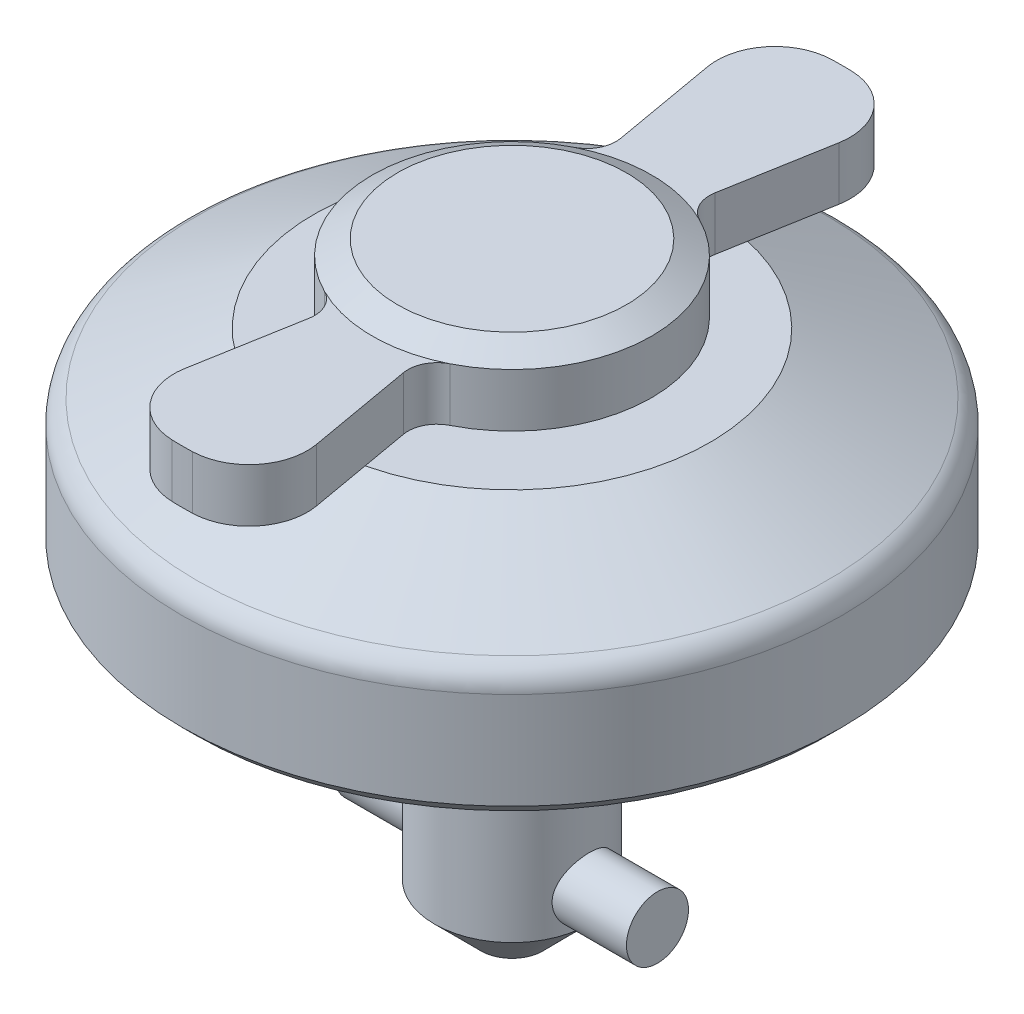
ISO-10303-21;
HEADER;
FILE_DESCRIPTION(('STEP AP214'),'2;1');
FILE_NAME('part.step','',(''),(''),'','','');
FILE_SCHEMA(('AUTOMOTIVE_DESIGN { 1 0 10303 214 1 1 1 1 }'));
ENDSEC;
DATA;
#1=APPLICATION_CONTEXT('core data for automotive mechanical design processes');
#2=APPLICATION_PROTOCOL_DEFINITION('international standard','automotive_design',2000,#1);
#3=PRODUCT_CONTEXT('',#1,'mechanical');
#4=PRODUCT('Part','Part','',(#3));
#5=PRODUCT_RELATED_PRODUCT_CATEGORY('part','',(#4));
#6=PRODUCT_DEFINITION_FORMATION('','',#4);
#7=PRODUCT_DEFINITION_CONTEXT('part definition',#1,'design');
#8=PRODUCT_DEFINITION('design','',#6,#7);
#9=PRODUCT_DEFINITION_SHAPE('','',#8);
#10=(LENGTH_UNIT() NAMED_UNIT(*) SI_UNIT(.MILLI.,.METRE.));
#11=(NAMED_UNIT(*) PLANE_ANGLE_UNIT() SI_UNIT($,.RADIAN.));
#12=(NAMED_UNIT(*) SI_UNIT($,.STERADIAN.) SOLID_ANGLE_UNIT());
#13=UNCERTAINTY_MEASURE_WITH_UNIT(LENGTH_MEASURE(1.E-05),#10,'distance_accuracy_value','');
#14=(GEOMETRIC_REPRESENTATION_CONTEXT(3) GLOBAL_UNCERTAINTY_ASSIGNED_CONTEXT((#13)) GLOBAL_UNIT_ASSIGNED_CONTEXT((#10,
#11,#12)) REPRESENTATION_CONTEXT('',''));
#15=CARTESIAN_POINT('',(0.,0.,0.));
#16=DIRECTION('',(0.,0.,1.));
#17=DIRECTION('',(1.,0.,0.));
#18=AXIS2_PLACEMENT_3D('',#15,#16,#17);
#19=CARTESIAN_POINT('',(0.,16.,0.));
#20=DIRECTION('',(0.,1.,0.));
#21=DIRECTION('',(0.,0.,1.));
#22=AXIS2_PLACEMENT_3D('',#19,#20,#21);
#23=CYLINDRICAL_SURFACE('',#22,7.2);
#24=CARTESIAN_POINT('',(0.,18.75,0.));
#25=DIRECTION('',(0.,1.,0.));
#26=DIRECTION('',(0.,0.,1.));
#27=AXIS2_PLACEMENT_3D('',#24,#25,#26);
#28=CIRCLE('',#27,7.2);
#29=CARTESIAN_POINT('',(-3.23506859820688,18.75,6.43228817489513));
#30=VERTEX_POINT('',#29);
#31=CARTESIAN_POINT('',(-3.23506859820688,18.75,-6.43228817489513));
#32=VERTEX_POINT('',#31);
#33=EDGE_CURVE('P0_E325',#30,#32,#28,.F.);
#34=ORIENTED_EDGE('',*,*,#33,.T.);
#35=DIRECTION('',(0.,1.,0.));
#36=VECTOR('',#35,1.);
#37=CARTESIAN_POINT('',(-3.23506859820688,16.,-6.43228817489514));
#38=LINE('',#37,#36);
#39=CARTESIAN_POINT('',(-3.23506859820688,16.,-6.43228817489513));
#40=VERTEX_POINT('',#39);
#41=EDGE_CURVE('P0_E242',#32,#40,#38,.F.);
#42=ORIENTED_EDGE('',*,*,#41,.T.);
#43=CARTESIAN_POINT('',(0.,16.,0.));
#44=DIRECTION('',(0.,1.,0.));
#45=DIRECTION('',(0.,0.,1.));
#46=AXIS2_PLACEMENT_3D('',#43,#44,#45);
#47=CIRCLE('',#46,7.2);
#48=CARTESIAN_POINT('',(-3.23506859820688,16.,6.43228817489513));
#49=VERTEX_POINT('',#48);
#50=EDGE_CURVE('P0_E222',#40,#49,#47,.T.);
#51=ORIENTED_EDGE('',*,*,#50,.T.);
#52=DIRECTION('',(0.,1.,0.));
#53=VECTOR('',#52,1.);
#54=CARTESIAN_POINT('',(-3.23506859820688,16.,6.43228817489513));
#55=LINE('',#54,#53);
#56=EDGE_CURVE('P0_E234',#49,#30,#55,.T.);
#57=ORIENTED_EDGE('',*,*,#56,.T.);
#58=EDGE_LOOP('',(#34,#42,#51,#57));
#59=FACE_BOUND('',#58,.T.);
#60=ADVANCED_FACE('P0_F16',(#59),#23,.T.);
#61=CARTESIAN_POINT('',(0.,-11.5,0.));
#62=DIRECTION('',(0.,-1.,0.));
#63=DIRECTION('',(0.,0.,-1.));
#64=AXIS2_PLACEMENT_3D('',#61,#62,#63);
#65=CYLINDRICAL_SURFACE('',#64,3.2);
#66=CARTESIAN_POINT('',(0.,0.,0.));
#67=DIRECTION('',(0.,-1.,0.));
#68=DIRECTION('',(0.,0.,-1.));
#69=AXIS2_PLACEMENT_3D('',#66,#67,#68);
#70=CIRCLE('',#69,3.2);
#71=CARTESIAN_POINT('',(0.,0.,-3.2));
#72=VERTEX_POINT('',#71);
#73=EDGE_CURVE('P0_E146',#72,#72,#70,.T.);
#74=ORIENTED_EDGE('',*,*,#73,.F.);
#75=EDGE_LOOP('',(#74));
#76=FACE_BOUND('',#75,.T.);
#77=CARTESIAN_POINT('',(0.,16.,0.));
#78=DIRECTION('',(0.,1.,0.));
#79=DIRECTION('',(0.,0.,1.));
#80=AXIS2_PLACEMENT_3D('',#77,#78,#79);
#81=CIRCLE('',#80,3.2);
#82=CARTESIAN_POINT('',(0.,16.,3.2));
#83=VERTEX_POINT('',#82);
#84=EDGE_CURVE('P0_E271',#83,#83,#81,.F.);
#85=ORIENTED_EDGE('',*,*,#84,.T.);
#86=EDGE_LOOP('',(#85));
#87=FACE_BOUND('',#86,.T.);
#88=ADVANCED_FACE('P0_F184',(#76,#87),#65,.T.);
#89=CARTESIAN_POINT('',(0.,-11.5,0.));
#90=DIRECTION('',(0.,-1.,0.));
#91=DIRECTION('',(0.,0.,-1.));
#92=AXIS2_PLACEMENT_3D('',#89,#90,#91);
#93=PLANE('',#92);
#94=CARTESIAN_POINT('',(0.,-11.5,0.));
#95=DIRECTION('',(0.,-1.,0.));
#96=DIRECTION('',(0.,0.,-1.));
#97=AXIS2_PLACEMENT_3D('',#94,#95,#96);
#98=CIRCLE('',#97,1.6);
#99=CARTESIAN_POINT('',(0.,-11.5,-1.6));
#100=VERTEX_POINT('',#99);
#101=EDGE_CURVE('P0_E137',#100,#100,#98,.T.);
#102=ORIENTED_EDGE('',*,*,#101,.T.);
#103=EDGE_LOOP('',(#102));
#104=FACE_BOUND('',#103,.T.);
#105=ADVANCED_FACE('P0_F186',(#104),#93,.T.);
#106=CARTESIAN_POINT('',(0.,-11.5,0.));
#107=DIRECTION('',(0.,1.,0.));
#108=DIRECTION('',(0.,0.,1.));
#109=AXIS2_PLACEMENT_3D('',#106,#107,#108);
#110=CONICAL_SURFACE('',#109,1.6,0.78539816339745);
#111=CARTESIAN_POINT('',(0.,-9.10000000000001,0.));
#112=DIRECTION('',(0.,-1.,0.));
#113=DIRECTION('',(0.,0.,-1.));
#114=AXIS2_PLACEMENT_3D('',#111,#112,#113);
#115=CIRCLE('',#114,4.);
#116=CARTESIAN_POINT('',(4.00000000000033,-9.10000000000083,0.));
#117=VERTEX_POINT('',#116);
#118=CARTESIAN_POINT('',(-4.,-9.10000000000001,0.));
#119=VERTEX_POINT('',#118);
#120=EDGE_CURVE('P0_E129',#117,#119,#115,.T.);
#121=ORIENTED_EDGE('',*,*,#120,.T.);
#122=EDGE_CURVE('P0_E133',#119,#117,#115,.T.);
#123=ORIENTED_EDGE('',*,*,#122,.T.);
#124=EDGE_LOOP('',(#121,#123));
#125=FACE_BOUND('',#124,.T.);
#126=ORIENTED_EDGE('',*,*,#101,.F.);
#127=EDGE_LOOP('',(#126));
#128=FACE_BOUND('',#127,.T.);
#129=ADVANCED_FACE('P0_F131',(#125,#128),#110,.T.);
#130=CARTESIAN_POINT('',(0.,-11.5,0.));
#131=DIRECTION('',(0.,-1.,0.));
#132=DIRECTION('',(0.,0.,-1.));
#133=AXIS2_PLACEMENT_3D('',#130,#131,#132);
#134=CYLINDRICAL_SURFACE('',#133,4.);
#135=CARTESIAN_POINT('',(0.,0.,0.));
#136=DIRECTION('',(0.,-1.,0.));
#137=DIRECTION('',(0.,0.,-1.));
#138=AXIS2_PLACEMENT_3D('',#135,#136,#137);
#139=CIRCLE('',#138,4.);
#140=CARTESIAN_POINT('',(0.,0.,-4.));
#141=VERTEX_POINT('',#140);
#142=EDGE_CURVE('P0_E144',#141,#141,#139,.T.);
#143=ORIENTED_EDGE('',*,*,#142,.T.);
#144=EDGE_LOOP('',(#143));
#145=FACE_BOUND('',#144,.T.);
#146=ORIENTED_EDGE('',*,*,#120,.F.);
#147=CARTESIAN_POINT('',(3.66606055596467,-7.50000000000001,1.6));
#148=CARTESIAN_POINT('',(3.66606921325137,-7.58571159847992,1.59999060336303));
#149=CARTESIAN_POINT('',(3.66910881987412,-7.67154442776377,1.59307185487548));
#150=CARTESIAN_POINT('',(3.68088731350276,-7.84074786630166,1.56565522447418));
#151=CARTESIAN_POINT('',(3.68964076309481,-7.9241116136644,1.5451226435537));
#152=CARTESIAN_POINT('',(3.71168364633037,-8.08564235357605,1.49138802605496));
#153=CARTESIAN_POINT('',(3.72495597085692,-8.16382763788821,1.45823372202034));
#154=CARTESIAN_POINT('',(3.75451732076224,-8.3135080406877,1.38033621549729));
#155=CARTESIAN_POINT('',(3.77080568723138,-8.3850046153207,1.335595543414));
#156=CARTESIAN_POINT('',(3.80560692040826,-8.52340832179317,1.23305757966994));
#157=CARTESIAN_POINT('',(3.82419134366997,-8.58988513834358,1.17470348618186));
#158=CARTESIAN_POINT('',(3.86089965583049,-8.71242319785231,1.04776728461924));
#159=CARTESIAN_POINT('',(3.87902338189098,-8.7684808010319,0.979181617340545));
#160=CARTESIAN_POINT('',(3.91362726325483,-8.87072511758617,0.830405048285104));
#161=CARTESIAN_POINT('',(3.93001442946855,-8.91643544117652,0.749863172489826));
#162=CARTESIAN_POINT('',(3.95843142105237,-8.99347485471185,0.581460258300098));
#163=CARTESIAN_POINT('',(3.97046301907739,-9.02480979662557,0.493602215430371));
#164=CARTESIAN_POINT('',(3.98830660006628,-9.07067318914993,0.317573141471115));
#165=CARTESIAN_POINT('',(3.99439149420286,-9.08594185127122,0.229623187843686));
#166=CARTESIAN_POINT('',(4.00064248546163,-9.10162278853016,0.0522130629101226));
#167=CARTESIAN_POINT('',(4.0008107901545,-9.10204060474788,-0.0372465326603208));
#168=CARTESIAN_POINT('',(3.99537570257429,-9.08841378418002,-0.209785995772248));
#169=CARTESIAN_POINT('',(3.99009597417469,-9.07518018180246,-0.292941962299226));
#170=CARTESIAN_POINT('',(3.97479433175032,-9.0360056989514,-0.455738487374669));
#171=CARTESIAN_POINT('',(3.9647720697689,-9.0100638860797,-0.535378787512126));
#172=CARTESIAN_POINT('',(3.9407745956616,-8.94589081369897,-0.690318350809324));
#173=CARTESIAN_POINT('',(3.9267420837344,-8.90748022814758,-0.765534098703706));
#174=CARTESIAN_POINT('',(3.89611668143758,-8.8196279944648,-0.908646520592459));
#175=CARTESIAN_POINT('',(3.87952291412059,-8.77018256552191,-0.976540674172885));
#176=CARTESIAN_POINT('',(3.84417309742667,-8.65788069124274,-1.10781506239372));
#177=CARTESIAN_POINT('',(3.82534661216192,-8.59435688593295,-1.17060627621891));
#178=CARTESIAN_POINT('',(3.78849328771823,-8.45760754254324,-1.28488593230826));
#179=CARTESIAN_POINT('',(3.77046671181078,-8.38437884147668,-1.33637067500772));
#180=CARTESIAN_POINT('',(3.7367751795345,-8.22766478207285,-1.42792335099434));
#181=CARTESIAN_POINT('',(3.72119131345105,-8.14394813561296,-1.46762772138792));
#182=CARTESIAN_POINT('',(3.69510072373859,-7.9702276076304,-1.53214100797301));
#183=CARTESIAN_POINT('',(3.68459070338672,-7.88022785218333,-1.55695959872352));
#184=CARTESIAN_POINT('',(3.67063807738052,-7.70237137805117,-1.58956395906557));
#185=CARTESIAN_POINT('',(3.6668029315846,-7.61471964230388,-1.59829767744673));
#186=CARTESIAN_POINT('',(3.66551598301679,-7.43913823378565,-1.60124906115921));
#187=CARTESIAN_POINT('',(3.6680622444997,-7.35120865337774,-1.59547112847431));
#188=CARTESIAN_POINT('',(3.67884835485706,-7.18283285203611,-1.57042631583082));
#189=CARTESIAN_POINT('',(3.68675566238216,-7.10224565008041,-1.55194644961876));
#190=CARTESIAN_POINT('',(3.70696040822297,-6.9453692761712,-1.50304334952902));
#191=CARTESIAN_POINT('',(3.71925881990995,-6.86908106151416,-1.47261746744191));
#192=CARTESIAN_POINT('',(3.7474702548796,-6.71951811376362,-1.39930851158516));
#193=CARTESIAN_POINT('',(3.76350963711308,-6.64649104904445,-1.35597029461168));
#194=CARTESIAN_POINT('',(3.7972030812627,-6.50841361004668,-1.2585321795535));
#195=CARTESIAN_POINT('',(3.8148577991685,-6.44336650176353,-1.20442789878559));
#196=CARTESIAN_POINT('',(3.85136732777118,-6.31810127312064,-1.08227536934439));
#197=CARTESIAN_POINT('',(3.87021445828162,-6.25859474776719,-1.01349234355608));
#198=CARTESIAN_POINT('',(3.9057583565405,-6.15185833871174,-0.866466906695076));
#199=CARTESIAN_POINT('',(3.92245503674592,-6.10462895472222,-0.788224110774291));
#200=CARTESIAN_POINT('',(3.95186972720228,-6.02396189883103,-0.624223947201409));
#201=CARTESIAN_POINT('',(3.96458868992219,-5.99052092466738,-0.538468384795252));
#202=CARTESIAN_POINT('',(3.98458170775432,-5.93876091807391,-0.36191487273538));
#203=CARTESIAN_POINT('',(3.99185871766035,-5.92043367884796,-0.271119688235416));
#204=CARTESIAN_POINT('',(3.9998320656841,-5.9003962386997,-0.0934532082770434));
#205=CARTESIAN_POINT('',(4.00092677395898,-5.89767989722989,-0.00671239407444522));
#206=CARTESIAN_POINT('',(3.99748833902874,-5.90628438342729,0.165947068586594));
#207=CARTESIAN_POINT('',(3.9929560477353,-5.91760308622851,0.251865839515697));
#208=CARTESIAN_POINT('',(3.97897210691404,-5.95323743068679,0.417736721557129));
#209=CARTESIAN_POINT('',(3.96967584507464,-5.97714315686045,0.497791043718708));
#210=CARTESIAN_POINT('',(3.9471595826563,-6.03684224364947,0.652737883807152));
#211=CARTESIAN_POINT('',(3.93393885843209,-6.07263779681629,0.72762944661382));
#212=CARTESIAN_POINT('',(3.90414475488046,-6.15688255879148,0.873762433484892));
#213=CARTESIAN_POINT('',(3.88744903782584,-6.20582103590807,0.94469630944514));
#214=CARTESIAN_POINT('',(3.85271522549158,-6.31423081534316,1.07764322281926));
#215=CARTESIAN_POINT('',(3.834676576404,-6.3737064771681,1.1396525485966));
#216=CARTESIAN_POINT('',(3.79790210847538,-6.50585217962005,1.25696101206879));
#217=CARTESIAN_POINT('',(3.77919226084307,-6.57911109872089,1.31160710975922));
#218=CARTESIAN_POINT('',(3.74439737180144,-6.73435370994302,1.40787796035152));
#219=CARTESIAN_POINT('',(3.72831263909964,-6.81633842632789,1.44950118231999));
#220=CARTESIAN_POINT('',(3.70207091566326,-6.97922976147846,1.51519287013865));
#221=CARTESIAN_POINT('',(3.69151134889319,-7.05957218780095,1.54050201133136));
#222=CARTESIAN_POINT('',(3.67556802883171,-7.22358833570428,1.57817420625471));
#223=CARTESIAN_POINT('',(3.6701698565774,-7.30725209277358,1.59057333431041));
#224=CARTESIAN_POINT('',(3.66659567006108,-7.42750204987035,1.59877140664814));
#225=CARTESIAN_POINT('',(3.66605689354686,-7.46374017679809,1.6000039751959));
#226=CARTESIAN_POINT('',(3.66606055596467,-7.50000000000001,1.6));
#227=B_SPLINE_CURVE_WITH_KNOTS('',3,(#147,#148,#149,#150,#151,#152,#153,#154,#155,#156,#157,
#158,#159,#160,#161,#162,#163,#164,#165,#166,#167,#168,#169,#170,#171,#172,#173,#174,#175,#176,
#177,#178,#179,#180,#181,#182,#183,#184,#185,#186,#187,#188,#189,#190,#191,#192,#193,#194,#195,
#196,#197,#198,#199,#200,#201,#202,#203,#204,#205,#206,#207,#208,#209,#210,#211,#212,#213,#214,
#215,#216,#217,#218,#219,#220,#221,#222,#223,#224,#225,#226),.UNSPECIFIED.,.T.,.F.,(4,2,2,2,2,2,
2,2,2,2,2,2,2,2,2,2,2,2,2,2,2,2,2,2,2,2,2,2,2,2,2,2,2,2,2,2,2,2,2,4),(0.,0.257022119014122,
0.514701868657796,0.771416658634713,1.02807543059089,1.2980449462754,1.56810859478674,
1.84882135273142,2.12941973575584,2.39643346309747,2.66334756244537,2.91526915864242,
3.16720924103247,3.42294640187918,3.67877131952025,3.95139235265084,4.22410245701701,
4.50451566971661,4.78474643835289,5.04785718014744,5.3108881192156,5.55893798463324,
5.80704286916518,6.06520923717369,6.32348091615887,6.60082987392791,6.87819011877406,
7.15548389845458,7.43262700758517,7.6916883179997,7.95071041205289,8.2017759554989,
8.45288782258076,8.71509640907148,8.97741373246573,9.25597002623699,9.53455905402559,
9.78813328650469,10.040997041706,10.1497288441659),.UNSPECIFIED.);
#228=EDGE_CURVE('P0_E143',#117,#117,#227,.T.);
#229=ORIENTED_EDGE('',*,*,#228,.F.);
#230=ORIENTED_EDGE('',*,*,#122,.F.);
#231=CARTESIAN_POINT('',(-3.66606055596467,-7.50000000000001,1.6));
#232=CARTESIAN_POINT('',(-3.66606921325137,-7.4142884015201,1.59999060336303));
#233=CARTESIAN_POINT('',(-3.66910881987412,-7.32845557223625,1.59307185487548));
#234=CARTESIAN_POINT('',(-3.68088731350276,-7.15925213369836,1.56565522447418));
#235=CARTESIAN_POINT('',(-3.68964076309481,-7.07588838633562,1.5451226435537));
#236=CARTESIAN_POINT('',(-3.71168364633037,-6.91435764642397,1.49138802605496));
#237=CARTESIAN_POINT('',(-3.72495597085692,-6.8361723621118,1.45823372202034));
#238=CARTESIAN_POINT('',(-3.75451732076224,-6.68649195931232,1.38033621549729));
#239=CARTESIAN_POINT('',(-3.77080568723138,-6.61499538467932,1.335595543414));
#240=CARTESIAN_POINT('',(-3.80560692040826,-6.47659167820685,1.23305757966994));
#241=CARTESIAN_POINT('',(-3.82419134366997,-6.41011486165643,1.17470348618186));
#242=CARTESIAN_POINT('',(-3.86089965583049,-6.28757680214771,1.04776728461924));
#243=CARTESIAN_POINT('',(-3.87902338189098,-6.23151919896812,0.979181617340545));
#244=CARTESIAN_POINT('',(-3.91362726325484,-6.12927488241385,0.830405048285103));
#245=CARTESIAN_POINT('',(-3.93001442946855,-6.08356455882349,0.749863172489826));
#246=CARTESIAN_POINT('',(-3.95843142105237,-6.00652514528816,0.581460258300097));
#247=CARTESIAN_POINT('',(-3.97046301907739,-5.97519020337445,0.49360221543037));
#248=CARTESIAN_POINT('',(-3.98830660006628,-5.92932681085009,0.317573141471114));
#249=CARTESIAN_POINT('',(-3.99439149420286,-5.91405814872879,0.229623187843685));
#250=CARTESIAN_POINT('',(-4.00064248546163,-5.89837721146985,0.052213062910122));
#251=CARTESIAN_POINT('',(-4.0008107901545,-5.89795939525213,-0.0372465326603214));
#252=CARTESIAN_POINT('',(-3.99537570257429,-5.91158621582,-0.209785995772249));
#253=CARTESIAN_POINT('',(-3.99009597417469,-5.92481981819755,-0.292941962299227));
#254=CARTESIAN_POINT('',(-3.97479433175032,-5.96399430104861,-0.45573848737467));
#255=CARTESIAN_POINT('',(-3.9647720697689,-5.98993611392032,-0.535378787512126));
#256=CARTESIAN_POINT('',(-3.9407745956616,-6.05410918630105,-0.690318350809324));
#257=CARTESIAN_POINT('',(-3.9267420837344,-6.09251977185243,-0.765534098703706));
#258=CARTESIAN_POINT('',(-3.89611668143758,-6.18037200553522,-0.908646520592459));
#259=CARTESIAN_POINT('',(-3.87952291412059,-6.22981743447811,-0.976540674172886));
#260=CARTESIAN_POINT('',(-3.84417309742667,-6.34211930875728,-1.10781506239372));
#261=CARTESIAN_POINT('',(-3.82534661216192,-6.40564311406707,-1.17060627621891));
#262=CARTESIAN_POINT('',(-3.78849328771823,-6.54239245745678,-1.28488593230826));
#263=CARTESIAN_POINT('',(-3.77046671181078,-6.61562115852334,-1.33637067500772));
#264=CARTESIAN_POINT('',(-3.7367751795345,-6.77233521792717,-1.42792335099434));
#265=CARTESIAN_POINT('',(-3.72119131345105,-6.85605186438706,-1.46762772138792));
#266=CARTESIAN_POINT('',(-3.69510072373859,-7.02977239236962,-1.53214100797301));
#267=CARTESIAN_POINT('',(-3.68459070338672,-7.11977214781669,-1.55695959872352));
#268=CARTESIAN_POINT('',(-3.67063807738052,-7.29762862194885,-1.58956395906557));
#269=CARTESIAN_POINT('',(-3.66680293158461,-7.38528035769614,-1.59829767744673));
#270=CARTESIAN_POINT('',(-3.66551598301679,-7.56086176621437,-1.60124906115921));
#271=CARTESIAN_POINT('',(-3.6680622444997,-7.64879134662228,-1.59547112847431));
#272=CARTESIAN_POINT('',(-3.67884835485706,-7.81716714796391,-1.57042631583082));
#273=CARTESIAN_POINT('',(-3.68675566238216,-7.89775434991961,-1.55194644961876));
#274=CARTESIAN_POINT('',(-3.70696040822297,-8.05463072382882,-1.50304334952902));
#275=CARTESIAN_POINT('',(-3.71925881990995,-8.13091893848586,-1.47261746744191));
#276=CARTESIAN_POINT('',(-3.7474702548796,-8.2804818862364,-1.39930851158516));
#277=CARTESIAN_POINT('',(-3.76350963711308,-8.35350895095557,-1.35597029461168));
#278=CARTESIAN_POINT('',(-3.7972030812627,-8.49158638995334,-1.2585321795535));
#279=CARTESIAN_POINT('',(-3.8148577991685,-8.55663349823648,-1.20442789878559));
#280=CARTESIAN_POINT('',(-3.85136732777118,-8.68189872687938,-1.08227536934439));
#281=CARTESIAN_POINT('',(-3.87021445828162,-8.74140525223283,-1.01349234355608));
#282=CARTESIAN_POINT('',(-3.9057583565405,-8.84814166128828,-0.866466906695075));
#283=CARTESIAN_POINT('',(-3.92245503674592,-8.8953710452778,-0.788224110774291));
#284=CARTESIAN_POINT('',(-3.95186972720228,-8.97603810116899,-0.624223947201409));
#285=CARTESIAN_POINT('',(-3.96458868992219,-9.00947907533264,-0.538468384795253));
#286=CARTESIAN_POINT('',(-3.98458170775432,-9.06123908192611,-0.36191487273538));
#287=CARTESIAN_POINT('',(-3.99185871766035,-9.07956632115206,-0.271119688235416));
#288=CARTESIAN_POINT('',(-3.9998320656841,-9.09960376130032,-0.0934532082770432));
#289=CARTESIAN_POINT('',(-4.00092677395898,-9.10232010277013,-0.00671239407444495));
#290=CARTESIAN_POINT('',(-3.99748833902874,-9.09371561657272,0.165947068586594));
#291=CARTESIAN_POINT('',(-3.9929560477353,-9.08239691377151,0.251865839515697));
#292=CARTESIAN_POINT('',(-3.97897210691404,-9.04676256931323,0.417736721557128));
#293=CARTESIAN_POINT('',(-3.96967584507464,-9.02285684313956,0.497791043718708));
#294=CARTESIAN_POINT('',(-3.9471595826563,-8.96315775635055,0.652737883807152));
#295=CARTESIAN_POINT('',(-3.93393885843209,-8.92736220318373,0.72762944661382));
#296=CARTESIAN_POINT('',(-3.90414475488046,-8.84311744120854,0.873762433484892));
#297=CARTESIAN_POINT('',(-3.88744903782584,-8.79417896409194,0.94469630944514));
#298=CARTESIAN_POINT('',(-3.85271522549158,-8.68576918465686,1.07764322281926));
#299=CARTESIAN_POINT('',(-3.834676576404,-8.62629352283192,1.1396525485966));
#300=CARTESIAN_POINT('',(-3.79790210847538,-8.49414782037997,1.25696101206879));
#301=CARTESIAN_POINT('',(-3.77919226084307,-8.42088890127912,1.31160710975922));
#302=CARTESIAN_POINT('',(-3.74439737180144,-8.26564629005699,1.40787796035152));
#303=CARTESIAN_POINT('',(-3.72831263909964,-8.18366157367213,1.44950118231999));
#304=CARTESIAN_POINT('',(-3.70207091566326,-8.02077023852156,1.51519287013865));
#305=CARTESIAN_POINT('',(-3.69151134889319,-7.94042781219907,1.54050201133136));
#306=CARTESIAN_POINT('',(-3.67556802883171,-7.77641166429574,1.57817420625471));
#307=CARTESIAN_POINT('',(-3.6701698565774,-7.69274790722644,1.59057333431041));
#308=CARTESIAN_POINT('',(-3.66659567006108,-7.57249795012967,1.59877140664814));
#309=CARTESIAN_POINT('',(-3.66605689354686,-7.53625982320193,1.6000039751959));
#310=CARTESIAN_POINT('',(-3.66606055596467,-7.50000000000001,1.6));
#311=B_SPLINE_CURVE_WITH_KNOTS('',3,(#231,#232,#233,#234,#235,#236,#237,#238,#239,#240,#241,
#242,#243,#244,#245,#246,#247,#248,#249,#250,#251,#252,#253,#254,#255,#256,#257,#258,#259,#260,
#261,#262,#263,#264,#265,#266,#267,#268,#269,#270,#271,#272,#273,#274,#275,#276,#277,#278,#279,
#280,#281,#282,#283,#284,#285,#286,#287,#288,#289,#290,#291,#292,#293,#294,#295,#296,#297,#298,
#299,#300,#301,#302,#303,#304,#305,#306,#307,#308,#309,#310),.UNSPECIFIED.,.T.,.F.,(4,2,2,2,2,2,
2,2,2,2,2,2,2,2,2,2,2,2,2,2,2,2,2,2,2,2,2,2,2,2,2,2,2,2,2,2,2,2,2,4),(0.,0.257022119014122,
0.514701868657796,0.771416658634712,1.02807543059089,1.2980449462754,1.56810859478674,
1.84882135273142,2.12941973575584,2.39643346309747,2.66334756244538,2.91526915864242,
3.16720924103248,3.42294640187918,3.67877131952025,3.95139235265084,4.22410245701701,
4.50451566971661,4.78474643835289,5.04785718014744,5.31088811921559,5.55893798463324,
5.80704286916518,6.06520923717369,6.32348091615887,6.60082987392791,6.87819011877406,
7.15548389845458,7.43262700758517,7.6916883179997,7.95071041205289,8.2017759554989,
8.45288782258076,8.71509640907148,8.97741373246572,9.25597002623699,9.53455905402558,
9.78813328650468,10.040997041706,10.1497288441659),.UNSPECIFIED.);
#312=EDGE_CURVE('P0_E141',#119,#119,#311,.T.);
#313=ORIENTED_EDGE('',*,*,#312,.F.);
#314=EDGE_LOOP('',(#146,#229,#230,#313));
#315=FACE_BOUND('',#314,.T.);
#316=ADVANCED_FACE('P0_F139',(#145,#315),#134,.T.);
#317=CARTESIAN_POINT('',(4.,0.,0.));
#318=DIRECTION('',(0.,1.,0.));
#319=DIRECTION('',(0.,0.,1.));
#320=AXIS2_PLACEMENT_3D('',#317,#318,#319);
#321=PLANE('',#320);
#322=ORIENTED_EDGE('',*,*,#73,.T.);
#323=EDGE_LOOP('',(#322));
#324=FACE_BOUND('',#323,.T.);
#325=ORIENTED_EDGE('',*,*,#142,.F.);
#326=EDGE_LOOP('',(#325));
#327=FACE_BOUND('',#326,.T.);
#328=ADVANCED_FACE('P0_F176',(#324,#327),#321,.T.);
#329=CARTESIAN_POINT('',(-7.5,-7.50000000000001,0.));
#330=DIRECTION('',(-1.,0.,0.));
#331=DIRECTION('',(0.,0.,1.));
#332=AXIS2_PLACEMENT_3D('',#329,#330,#331);
#333=PLANE('',#332);
#334=CARTESIAN_POINT('',(-7.5,-7.50000000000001,0.));
#335=DIRECTION('',(-1.,0.,0.));
#336=DIRECTION('',(0.,0.,1.));
#337=AXIS2_PLACEMENT_3D('',#334,#335,#336);
#338=CIRCLE('',#337,1.6);
#339=CARTESIAN_POINT('',(-7.5,-7.50000000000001,1.6));
#340=VERTEX_POINT('',#339);
#341=EDGE_CURVE('P0_E315',#340,#340,#338,.T.);
#342=ORIENTED_EDGE('',*,*,#341,.T.);
#343=EDGE_LOOP('',(#342));
#344=FACE_BOUND('',#343,.T.);
#345=ADVANCED_FACE('P0_F169',(#344),#333,.T.);
#346=CARTESIAN_POINT('',(-5.26029262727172,-7.50000000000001,0.));
#347=DIRECTION('',(-1.,0.,0.));
#348=DIRECTION('',(0.,0.,1.));
#349=AXIS2_PLACEMENT_3D('',#346,#347,#348);
#350=CYLINDRICAL_SURFACE('',#349,1.6);
#351=ORIENTED_EDGE('',*,*,#312,.T.);
#352=EDGE_LOOP('',(#351));
#353=FACE_BOUND('',#352,.T.);
#354=ORIENTED_EDGE('',*,*,#341,.F.);
#355=EDGE_LOOP('',(#354));
#356=FACE_BOUND('',#355,.T.);
#357=ADVANCED_FACE('P0_F163',(#353,#356),#350,.T.);
#358=ORIENTED_EDGE('',*,*,#228,.T.);
#359=EDGE_LOOP('',(#358));
#360=FACE_BOUND('',#359,.T.);
#361=CARTESIAN_POINT('',(7.5,-7.50000000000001,0.));
#362=DIRECTION('',(-1.,0.,0.));
#363=DIRECTION('',(0.,0.,1.));
#364=AXIS2_PLACEMENT_3D('',#361,#362,#363);
#365=CIRCLE('',#364,1.6);
#366=CARTESIAN_POINT('',(7.5,-7.50000000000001,1.6));
#367=VERTEX_POINT('',#366);
#368=EDGE_CURVE('P0_E312',#367,#367,#365,.T.);
#369=ORIENTED_EDGE('',*,*,#368,.T.);
#370=EDGE_LOOP('',(#369));
#371=FACE_BOUND('',#370,.T.);
#372=ADVANCED_FACE('P0_F168',(#360,#371),#350,.T.);
#373=CARTESIAN_POINT('',(7.5,-9.10000000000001,0.));
#374=DIRECTION('',(1.,0.,0.));
#375=DIRECTION('',(0.,0.,-1.));
#376=AXIS2_PLACEMENT_3D('',#373,#374,#375);
#377=PLANE('',#376);
#378=ORIENTED_EDGE('',*,*,#368,.F.);
#379=EDGE_LOOP('',(#378));
#380=FACE_BOUND('',#379,.T.);
#381=ADVANCED_FACE('P0_F171',(#380),#377,.T.);
#382=CARTESIAN_POINT('',(3.23506859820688,16.,6.43228817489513));
#383=VERTEX_POINT('',#382);
#384=CARTESIAN_POINT('',(3.23506859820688,16.,-6.43228817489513));
#385=VERTEX_POINT('',#384);
#386=EDGE_CURVE('P0_E215',#383,#385,#47,.T.);
#387=ORIENTED_EDGE('',*,*,#386,.T.);
#388=DIRECTION('',(0.,1.,0.));
#389=VECTOR('',#388,1.);
#390=CARTESIAN_POINT('',(3.23506859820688,16.,-6.43228817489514));
#391=LINE('',#390,#389);
#392=CARTESIAN_POINT('',(3.23506859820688,18.75,-6.43228817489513));
#393=VERTEX_POINT('',#392);
#394=EDGE_CURVE('P0_E218',#385,#393,#391,.T.);
#395=ORIENTED_EDGE('',*,*,#394,.T.);
#396=CARTESIAN_POINT('',(3.23506859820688,18.75,6.43228817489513));
#397=VERTEX_POINT('',#396);
#398=EDGE_CURVE('P0_E328',#393,#397,#28,.F.);
#399=ORIENTED_EDGE('',*,*,#398,.T.);
#400=DIRECTION('',(0.,1.,0.));
#401=VECTOR('',#400,1.);
#402=CARTESIAN_POINT('',(3.23506859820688,16.,6.43228817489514));
#403=LINE('',#402,#401);
#404=EDGE_CURVE('P0_E220',#397,#383,#403,.F.);
#405=ORIENTED_EDGE('',*,*,#404,.T.);
#406=EDGE_LOOP('',(#387,#395,#399,#405));
#407=FACE_BOUND('',#406,.T.);
#408=ADVANCED_FACE('P0_F199',(#407),#23,.T.);
#409=CARTESIAN_POINT('',(0.,16.,0.));
#410=DIRECTION('',(0.,1.,0.));
#411=DIRECTION('',(0.,0.,1.));
#412=AXIS2_PLACEMENT_3D('',#409,#410,#411);
#413=PLANE('',#412);
#414=ORIENTED_EDGE('',*,*,#84,.F.);
#415=EDGE_LOOP('',(#414));
#416=FACE_BOUND('',#415,.T.);
#417=CARTESIAN_POINT('',(0.,16.,0.));
#418=DIRECTION('',(0.,-1.,0.));
#419=DIRECTION('',(0.,0.,-1.));
#420=AXIS2_PLACEMENT_3D('',#417,#418,#419);
#421=CIRCLE('',#420,17.);
#422=CARTESIAN_POINT('',(-0.530065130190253,16.,-16.9917341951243));
#423=VERTEX_POINT('',#422);
#424=CARTESIAN_POINT('',(0.530065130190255,16.,-16.9917341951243));
#425=VERTEX_POINT('',#424);
#426=EDGE_CURVE('P0_E309',#423,#425,#421,.T.);
#427=ORIENTED_EDGE('',*,*,#426,.T.);
#428=CARTESIAN_POINT('',(0.436524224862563,16.,-13.993192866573));
#429=DIRECTION('',(0.,1.,0.));
#430=DIRECTION('',(0.,0.,1.));
#431=AXIS2_PLACEMENT_3D('',#428,#429,#430);
#432=CIRCLE('',#431,3.);
#433=CARTESIAN_POINT('',(3.39094748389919,16.,-13.4722483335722));
#434=VERTEX_POINT('',#433);
#435=EDGE_CURVE('P0_E339',#425,#434,#432,.F.);
#436=ORIENTED_EDGE('',*,*,#435,.T.);
#437=DIRECTION('',(0.173648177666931,0.,-0.984807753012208));
#438=VECTOR('',#437,1.);
#439=CARTESIAN_POINT('',(5.92038481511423,16.,-27.8174002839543));
#440=LINE('',#439,#438);
#441=CARTESIAN_POINT('',(2.431829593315,16.,-8.03282047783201));
#442=VERTEX_POINT('',#441);
#443=EDGE_CURVE('P0_E304',#442,#434,#440,.T.);
#444=ORIENTED_EDGE('',*,*,#443,.F.);
#445=CARTESIAN_POINT('',(3.90904122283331,16.,-7.77234821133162));
#446=DIRECTION('',(0.,1.,0.));
#447=DIRECTION('',(0.,0.,1.));
#448=AXIS2_PLACEMENT_3D('',#445,#446,#447);
#449=CIRCLE('',#448,1.5);
#450=EDGE_CURVE('P0_E229',#442,#385,#449,.T.);
#451=ORIENTED_EDGE('',*,*,#450,.T.);
#452=ORIENTED_EDGE('',*,*,#386,.F.);
#453=CARTESIAN_POINT('',(3.90904122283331,16.,7.77234821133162));
#454=DIRECTION('',(0.,1.,0.));
#455=DIRECTION('',(0.,0.,1.));
#456=AXIS2_PLACEMENT_3D('',#453,#454,#455);
#457=CIRCLE('',#456,1.5);
#458=CARTESIAN_POINT('',(2.431829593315,16.,8.03282047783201));
#459=VERTEX_POINT('',#458);
#460=EDGE_CURVE('P0_E252',#383,#459,#457,.T.);
#461=ORIENTED_EDGE('',*,*,#460,.T.);
#462=DIRECTION('',(0.173648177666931,0.,0.984807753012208));
#463=VECTOR('',#462,1.);
#464=CARTESIAN_POINT('',(-3.95076930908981,16.,-28.1646966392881));
#465=LINE('',#464,#463);
#466=CARTESIAN_POINT('',(3.39094748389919,16.,13.4722483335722));
#467=VERTEX_POINT('',#466);
#468=EDGE_CURVE('P0_E295',#459,#467,#465,.T.);
#469=ORIENTED_EDGE('',*,*,#468,.T.);
#470=CARTESIAN_POINT('',(0.436524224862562,16.,13.993192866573));
#471=DIRECTION('',(0.,1.,0.));
#472=DIRECTION('',(0.,0.,1.));
#473=AXIS2_PLACEMENT_3D('',#470,#471,#472);
#474=CIRCLE('',#473,3.);
#475=CARTESIAN_POINT('',(0.530065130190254,16.,16.9917341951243));
#476=VERTEX_POINT('',#475);
#477=EDGE_CURVE('P0_E337',#467,#476,#474,.F.);
#478=ORIENTED_EDGE('',*,*,#477,.T.);
#479=CARTESIAN_POINT('',(0.,16.,0.));
#480=DIRECTION('',(0.,-1.,0.));
#481=DIRECTION('',(0.,0.,-1.));
#482=AXIS2_PLACEMENT_3D('',#479,#480,#481);
#483=CIRCLE('',#482,17.);
#484=CARTESIAN_POINT('',(-0.53006513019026,16.,16.9917341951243));
#485=VERTEX_POINT('',#484);
#486=EDGE_CURVE('P0_E297',#476,#485,#483,.T.);
#487=ORIENTED_EDGE('',*,*,#486,.T.);
#488=CARTESIAN_POINT('',(-0.436524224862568,16.,13.993192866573));
#489=DIRECTION('',(0.,1.,0.));
#490=DIRECTION('',(0.,0.,1.));
#491=AXIS2_PLACEMENT_3D('',#488,#489,#490);
#492=CIRCLE('',#491,3.);
#493=CARTESIAN_POINT('',(-3.39094748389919,16.,13.4722483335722));
#494=VERTEX_POINT('',#493);
#495=EDGE_CURVE('P0_E335',#485,#494,#492,.F.);
#496=ORIENTED_EDGE('',*,*,#495,.T.);
#497=DIRECTION('',(-0.173648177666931,0.,0.984807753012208));
#498=VECTOR('',#497,1.);
#499=CARTESIAN_POINT('',(3.95076930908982,16.,-28.1646966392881));
#500=LINE('',#499,#498);
#501=CARTESIAN_POINT('',(-2.431829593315,16.,8.03282047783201));
#502=VERTEX_POINT('',#501);
#503=EDGE_CURVE('P0_E266',#502,#494,#500,.T.);
#504=ORIENTED_EDGE('',*,*,#503,.F.);
#505=CARTESIAN_POINT('',(-3.90904122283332,16.,7.77234821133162));
#506=DIRECTION('',(0.,1.,0.));
#507=DIRECTION('',(0.,0.,1.));
#508=AXIS2_PLACEMENT_3D('',#505,#506,#507);
#509=CIRCLE('',#508,1.5);
#510=EDGE_CURVE('P0_E25',#502,#49,#509,.T.);
#511=ORIENTED_EDGE('',*,*,#510,.T.);
#512=ORIENTED_EDGE('',*,*,#50,.F.);
#513=CARTESIAN_POINT('',(-3.90904122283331,16.,-7.77234821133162));
#514=DIRECTION('',(0.,1.,0.));
#515=DIRECTION('',(0.,0.,1.));
#516=AXIS2_PLACEMENT_3D('',#513,#514,#515);
#517=CIRCLE('',#516,1.5);
#518=CARTESIAN_POINT('',(-2.431829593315,16.,-8.03282047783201));
#519=VERTEX_POINT('',#518);
#520=EDGE_CURVE('P0_E257',#40,#519,#517,.T.);
#521=ORIENTED_EDGE('',*,*,#520,.T.);
#522=DIRECTION('',(-0.173648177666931,0.,-0.984807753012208));
#523=VECTOR('',#522,1.);
#524=CARTESIAN_POINT('',(-5.92038481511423,16.,-27.8174002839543));
#525=LINE('',#524,#523);
#526=CARTESIAN_POINT('',(-3.39094748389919,16.,-13.4722483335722));
#527=VERTEX_POINT('',#526);
#528=EDGE_CURVE('P0_E288',#519,#527,#525,.T.);
#529=ORIENTED_EDGE('',*,*,#528,.T.);
#530=CARTESIAN_POINT('',(-0.436524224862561,16.,-13.993192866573));
#531=DIRECTION('',(0.,1.,0.));
#532=DIRECTION('',(0.,0.,1.));
#533=AXIS2_PLACEMENT_3D('',#530,#531,#532);
#534=CIRCLE('',#533,3.);
#535=EDGE_CURVE('P0_E333',#527,#423,#534,.F.);
#536=ORIENTED_EDGE('',*,*,#535,.T.);
#537=EDGE_LOOP('',(#427,#436,#444,#451,#452,#461,#469,#478,#487,#496,#504,#511,#512,#521,#529,#536));
#538=FACE_BOUND('',#537,.T.);
#539=ADVANCED_FACE('P0_F182',(#416,#538),#413,.F.);
#540=CARTESIAN_POINT('',(2.4,19.5,0.));
#541=DIRECTION('',(0.,1.,0.));
#542=DIRECTION('',(0.,0.,1.));
#543=AXIS2_PLACEMENT_3D('',#540,#541,#542);
#544=PLANE('',#543);
#545=CARTESIAN_POINT('',(0.,19.5,0.));
#546=DIRECTION('',(0.,1.,0.));
#547=DIRECTION('',(0.,0.,1.));
#548=AXIS2_PLACEMENT_3D('',#545,#546,#547);
#549=CIRCLE('',#548,5.90096189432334);
#550=CARTESIAN_POINT('',(0.,19.5,5.90096189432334));
#551=VERTEX_POINT('',#550);
#552=EDGE_CURVE('P0_E322',#551,#551,#549,.T.);
#553=ORIENTED_EDGE('',*,*,#552,.T.);
#554=EDGE_LOOP('',(#553));
#555=FACE_BOUND('',#554,.T.);
#556=ADVANCED_FACE('P0_F178',(#555),#544,.T.);
#557=CARTESIAN_POINT('',(0.,19.5,0.));
#558=DIRECTION('',(0.,-1.,0.));
#559=DIRECTION('',(0.,0.,-1.));
#560=AXIS2_PLACEMENT_3D('',#557,#558,#559);
#561=CONICAL_SURFACE('',#560,5.90096189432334,1.0471975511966);
#562=EDGE_CURVE('P0_E32',#32,#393,#28,.F.);
#563=ORIENTED_EDGE('',*,*,#562,.F.);
#564=ORIENTED_EDGE('',*,*,#33,.F.);
#565=CARTESIAN_POINT('',(0.,18.75,0.));
#566=DIRECTION('',(0.,-1.,0.));
#567=DIRECTION('',(0.,0.,-1.));
#568=AXIS2_PLACEMENT_3D('',#565,#566,#567);
#569=CIRCLE('',#568,7.2);
#570=EDGE_CURVE('P0_E280',#397,#30,#569,.T.);
#571=ORIENTED_EDGE('',*,*,#570,.F.);
#572=ORIENTED_EDGE('',*,*,#398,.F.);
#573=EDGE_LOOP('',(#563,#564,#571,#572));
#574=FACE_BOUND('',#573,.T.);
#575=ORIENTED_EDGE('',*,*,#552,.F.);
#576=EDGE_LOOP('',(#575));
#577=FACE_BOUND('',#576,.T.);
#578=ADVANCED_FACE('P0_F181',(#574,#577),#561,.T.);
#579=CARTESIAN_POINT('',(-5.92038481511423,18.75,-27.8174002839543));
#580=DIRECTION('',(-0.984807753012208,0.,0.173648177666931));
#581=DIRECTION('',(0.173648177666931,0.,0.984807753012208));
#582=AXIS2_PLACEMENT_3D('',#579,#580,#581);
#583=PLANE('',#582);
#584=ORIENTED_EDGE('',*,*,#528,.F.);
#585=DIRECTION('',(0.,-1.,0.));
#586=VECTOR('',#585,1.);
#587=CARTESIAN_POINT('',(-2.431829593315,18.75,-8.03282047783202));
#588=LINE('',#587,#586);
#589=CARTESIAN_POINT('',(-2.431829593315,18.75,-8.03282047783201));
#590=VERTEX_POINT('',#589);
#591=EDGE_CURVE('P0_E245',#519,#590,#588,.F.);
#592=ORIENTED_EDGE('',*,*,#591,.T.);
#593=DIRECTION('',(-0.173648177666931,0.,-0.984807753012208));
#594=VECTOR('',#593,1.);
#595=CARTESIAN_POINT('',(-5.92038481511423,18.75,-27.8174002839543));
#596=LINE('',#595,#594);
#597=CARTESIAN_POINT('',(-3.39094748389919,18.75,-13.4722483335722));
#598=VERTEX_POINT('',#597);
#599=EDGE_CURVE('P0_E301',#590,#598,#596,.T.);
#600=ORIENTED_EDGE('',*,*,#599,.T.);
#601=DIRECTION('',(0.,-1.,0.));
#602=VECTOR('',#601,1.);
#603=CARTESIAN_POINT('',(-3.39094748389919,18.75,-13.4722483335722));
#604=LINE('',#603,#602);
#605=EDGE_CURVE('P0_E364',#598,#527,#604,.T.);
#606=ORIENTED_EDGE('',*,*,#605,.T.);
#607=EDGE_LOOP('',(#584,#592,#600,#606));
#608=FACE_BOUND('',#607,.T.);
#609=ADVANCED_FACE('P0_F394',(#608),#583,.T.);
#610=CARTESIAN_POINT('',(5.92038481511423,18.75,-27.8174002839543));
#611=DIRECTION('',(-0.984807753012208,0.,-0.173648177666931));
#612=DIRECTION('',(-0.173648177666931,0.,0.984807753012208));
#613=AXIS2_PLACEMENT_3D('',#610,#611,#612);
#614=PLANE('',#613);
#615=DIRECTION('',(0.173648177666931,0.,-0.984807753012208));
#616=VECTOR('',#615,1.);
#617=CARTESIAN_POINT('',(5.92038481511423,18.75,-27.8174002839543));
#618=LINE('',#617,#616);
#619=CARTESIAN_POINT('',(2.431829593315,18.75,-8.03282047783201));
#620=VERTEX_POINT('',#619);
#621=CARTESIAN_POINT('',(3.39094748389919,18.75,-13.4722483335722));
#622=VERTEX_POINT('',#621);
#623=EDGE_CURVE('P0_E223',#620,#622,#618,.T.);
#624=ORIENTED_EDGE('',*,*,#623,.F.);
#625=DIRECTION('',(0.,1.,0.));
#626=VECTOR('',#625,1.);
#627=CARTESIAN_POINT('',(2.431829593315,18.75,-8.03282047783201));
#628=LINE('',#627,#626);
#629=EDGE_CURVE('P0_E236',#620,#442,#628,.F.);
#630=ORIENTED_EDGE('',*,*,#629,.T.);
#631=ORIENTED_EDGE('',*,*,#443,.T.);
#632=DIRECTION('',(0.,1.,0.));
#633=VECTOR('',#632,1.);
#634=CARTESIAN_POINT('',(3.39094748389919,18.75,-13.4722483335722));
#635=LINE('',#634,#633);
#636=EDGE_CURVE('P0_E342',#434,#622,#635,.T.);
#637=ORIENTED_EDGE('',*,*,#636,.T.);
#638=EDGE_LOOP('',(#624,#630,#631,#637));
#639=FACE_BOUND('',#638,.T.);
#640=ADVANCED_FACE('P0_F369',(#639),#614,.F.);
#641=CARTESIAN_POINT('',(0.,18.75,0.));
#642=DIRECTION('',(0.,-1.,0.));
#643=DIRECTION('',(0.,0.,-1.));
#644=AXIS2_PLACEMENT_3D('',#641,#642,#643);
#645=CYLINDRICAL_SURFACE('',#644,17.);
#646=CARTESIAN_POINT('',(0.,18.75,0.));
#647=DIRECTION('',(0.,-1.,0.));
#648=DIRECTION('',(0.,0.,-1.));
#649=AXIS2_PLACEMENT_3D('',#646,#647,#648);
#650=CIRCLE('',#649,17.);
#651=CARTESIAN_POINT('',(-0.530065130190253,18.75,-16.9917341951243));
#652=VERTEX_POINT('',#651);
#653=CARTESIAN_POINT('',(0.530065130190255,18.75,-16.9917341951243));
#654=VERTEX_POINT('',#653);
#655=EDGE_CURVE('P0_E303',#652,#654,#650,.T.);
#656=ORIENTED_EDGE('',*,*,#655,.T.);
#657=DIRECTION('',(0.,-1.,0.));
#658=VECTOR('',#657,1.);
#659=CARTESIAN_POINT('',(0.530065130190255,18.75,-16.9917341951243));
#660=LINE('',#659,#658);
#661=EDGE_CURVE('P0_E330',#654,#425,#660,.T.);
#662=ORIENTED_EDGE('',*,*,#661,.T.);
#663=ORIENTED_EDGE('',*,*,#426,.F.);
#664=DIRECTION('',(0.,-1.,0.));
#665=VECTOR('',#664,1.);
#666=CARTESIAN_POINT('',(-0.530065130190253,18.75,-16.9917341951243));
#667=LINE('',#666,#665);
#668=EDGE_CURVE('P0_E327',#423,#652,#667,.F.);
#669=ORIENTED_EDGE('',*,*,#668,.T.);
#670=EDGE_LOOP('',(#656,#662,#663,#669));
#671=FACE_BOUND('',#670,.T.);
#672=ADVANCED_FACE('P0_F381',(#671),#645,.T.);
#673=CARTESIAN_POINT('',(0.,18.75,-28.8613238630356));
#674=DIRECTION('',(0.,-1.,0.));
#675=DIRECTION('',(0.,0.,-1.));
#676=AXIS2_PLACEMENT_3D('',#673,#674,#675);
#677=PLANE('',#676);
#678=ORIENTED_EDGE('',*,*,#562,.T.);
#679=CARTESIAN_POINT('',(3.90904122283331,18.75,-7.77234821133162));
#680=DIRECTION('',(0.,-1.,0.));
#681=DIRECTION('',(0.,0.,-1.));
#682=AXIS2_PLACEMENT_3D('',#679,#680,#681);
#683=CIRCLE('',#682,1.5);
#684=EDGE_CURVE('P0_E231',#393,#620,#683,.T.);
#685=ORIENTED_EDGE('',*,*,#684,.T.);
#686=ORIENTED_EDGE('',*,*,#623,.T.);
#687=CARTESIAN_POINT('',(0.436524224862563,18.75,-13.993192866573));
#688=DIRECTION('',(0.,-1.,0.));
#689=DIRECTION('',(0.,0.,-1.));
#690=AXIS2_PLACEMENT_3D('',#687,#688,#689);
#691=CIRCLE('',#690,3.);
#692=EDGE_CURVE('P0_E348',#622,#654,#691,.F.);
#693=ORIENTED_EDGE('',*,*,#692,.T.);
#694=ORIENTED_EDGE('',*,*,#655,.F.);
#695=CARTESIAN_POINT('',(-0.436524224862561,18.75,-13.993192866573));
#696=DIRECTION('',(0.,-1.,0.));
#697=DIRECTION('',(0.,0.,-1.));
#698=AXIS2_PLACEMENT_3D('',#695,#696,#697);
#699=CIRCLE('',#698,3.);
#700=EDGE_CURVE('P0_E345',#652,#598,#699,.F.);
#701=ORIENTED_EDGE('',*,*,#700,.T.);
#702=ORIENTED_EDGE('',*,*,#599,.F.);
#703=CARTESIAN_POINT('',(-3.90904122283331,18.75,-7.77234821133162));
#704=DIRECTION('',(0.,-1.,0.));
#705=DIRECTION('',(0.,0.,-1.));
#706=AXIS2_PLACEMENT_3D('',#703,#704,#705);
#707=CIRCLE('',#706,1.5);
#708=EDGE_CURVE('P0_E259',#590,#32,#707,.T.);
#709=ORIENTED_EDGE('',*,*,#708,.T.);
#710=EDGE_LOOP('',(#678,#685,#686,#693,#694,#701,#702,#709));
#711=FACE_BOUND('',#710,.T.);
#712=ADVANCED_FACE('P0_F378',(#711),#677,.F.);
#713=CARTESIAN_POINT('',(-3.95076930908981,18.75,-28.1646966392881));
#714=DIRECTION('',(0.984807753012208,0.,-0.173648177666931));
#715=DIRECTION('',(-0.173648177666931,0.,-0.984807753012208));
#716=AXIS2_PLACEMENT_3D('',#713,#714,#715);
#717=PLANE('',#716);
#718=ORIENTED_EDGE('',*,*,#468,.F.);
#719=DIRECTION('',(0.,-1.,0.));
#720=VECTOR('',#719,1.);
#721=CARTESIAN_POINT('',(2.431829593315,18.75,8.03282047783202));
#722=LINE('',#721,#720);
#723=CARTESIAN_POINT('',(2.431829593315,18.75,8.03282047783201));
#724=VERTEX_POINT('',#723);
#725=EDGE_CURVE('P0_E232',#459,#724,#722,.F.);
#726=ORIENTED_EDGE('',*,*,#725,.T.);
#727=DIRECTION('',(0.173648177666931,0.,0.984807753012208));
#728=VECTOR('',#727,1.);
#729=CARTESIAN_POINT('',(-3.95076930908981,18.75,-28.1646966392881));
#730=LINE('',#729,#728);
#731=CARTESIAN_POINT('',(3.39094748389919,18.75,13.4722483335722));
#732=VERTEX_POINT('',#731);
#733=EDGE_CURVE('P0_E291',#724,#732,#730,.T.);
#734=ORIENTED_EDGE('',*,*,#733,.T.);
#735=DIRECTION('',(0.,-1.,0.));
#736=VECTOR('',#735,1.);
#737=CARTESIAN_POINT('',(3.39094748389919,18.75,13.4722483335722));
#738=LINE('',#737,#736);
#739=EDGE_CURVE('P0_E350',#732,#467,#738,.T.);
#740=ORIENTED_EDGE('',*,*,#739,.T.);
#741=EDGE_LOOP('',(#718,#726,#734,#740));
#742=FACE_BOUND('',#741,.T.);
#743=ADVANCED_FACE('P0_F408',(#742),#717,.T.);
#744=CARTESIAN_POINT('',(3.95076930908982,18.75,-28.1646966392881));
#745=DIRECTION('',(0.984807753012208,0.,0.173648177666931));
#746=DIRECTION('',(0.173648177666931,0.,-0.984807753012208));
#747=AXIS2_PLACEMENT_3D('',#744,#745,#746);
#748=PLANE('',#747);
#749=DIRECTION('',(-0.173648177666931,0.,0.984807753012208));
#750=VECTOR('',#749,1.);
#751=CARTESIAN_POINT('',(3.95076930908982,18.75,-28.1646966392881));
#752=LINE('',#751,#750);
#753=CARTESIAN_POINT('',(-2.431829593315,18.75,8.03282047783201));
#754=VERTEX_POINT('',#753);
#755=CARTESIAN_POINT('',(-3.39094748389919,18.75,13.4722483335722));
#756=VERTEX_POINT('',#755);
#757=EDGE_CURVE('P0_E278',#754,#756,#752,.T.);
#758=ORIENTED_EDGE('',*,*,#757,.F.);
#759=DIRECTION('',(0.,1.,0.));
#760=VECTOR('',#759,1.);
#761=CARTESIAN_POINT('',(-2.431829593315,18.75,8.03282047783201));
#762=LINE('',#761,#760);
#763=EDGE_CURVE('P0_E247',#754,#502,#762,.F.);
#764=ORIENTED_EDGE('',*,*,#763,.T.);
#765=ORIENTED_EDGE('',*,*,#503,.T.);
#766=DIRECTION('',(0.,1.,0.));
#767=VECTOR('',#766,1.);
#768=CARTESIAN_POINT('',(-3.39094748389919,18.75,13.4722483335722));
#769=LINE('',#768,#767);
#770=EDGE_CURVE('P0_E284',#494,#756,#769,.T.);
#771=ORIENTED_EDGE('',*,*,#770,.T.);
#772=EDGE_LOOP('',(#758,#764,#765,#771));
#773=FACE_BOUND('',#772,.T.);
#774=ADVANCED_FACE('P0_F282',(#773),#748,.F.);
#775=CARTESIAN_POINT('',(0.,18.75,0.));
#776=DIRECTION('',(0.,-1.,0.));
#777=DIRECTION('',(0.,0.,-1.));
#778=AXIS2_PLACEMENT_3D('',#775,#776,#777);
#779=CYLINDRICAL_SURFACE('',#778,17.);
#780=ORIENTED_EDGE('',*,*,#486,.F.);
#781=DIRECTION('',(0.,-1.,0.));
#782=VECTOR('',#781,1.);
#783=CARTESIAN_POINT('',(0.530065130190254,18.75,16.9917341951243));
#784=LINE('',#783,#782);
#785=CARTESIAN_POINT('',(0.530065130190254,18.75,16.9917341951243));
#786=VERTEX_POINT('',#785);
#787=EDGE_CURVE('P0_E356',#476,#786,#784,.F.);
#788=ORIENTED_EDGE('',*,*,#787,.T.);
#789=CARTESIAN_POINT('',(0.,18.75,0.));
#790=DIRECTION('',(0.,-1.,0.));
#791=DIRECTION('',(0.,0.,-1.));
#792=AXIS2_PLACEMENT_3D('',#789,#790,#791);
#793=CIRCLE('',#792,17.);
#794=CARTESIAN_POINT('',(-0.53006513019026,18.75,16.9917341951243));
#795=VERTEX_POINT('',#794);
#796=EDGE_CURVE('P0_E286',#786,#795,#793,.T.);
#797=ORIENTED_EDGE('',*,*,#796,.T.);
#798=DIRECTION('',(0.,-1.,0.));
#799=VECTOR('',#798,1.);
#800=CARTESIAN_POINT('',(-0.53006513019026,18.75,16.9917341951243));
#801=LINE('',#800,#799);
#802=EDGE_CURVE('P0_E353',#795,#485,#801,.T.);
#803=ORIENTED_EDGE('',*,*,#802,.T.);
#804=EDGE_LOOP('',(#780,#788,#797,#803));
#805=FACE_BOUND('',#804,.T.);
#806=ADVANCED_FACE('P0_F412',(#805),#779,.T.);
#807=CARTESIAN_POINT('',(0.,18.75,-28.8613238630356));
#808=DIRECTION('',(0.,-1.,0.));
#809=DIRECTION('',(0.,0.,-1.));
#810=AXIS2_PLACEMENT_3D('',#807,#808,#809);
#811=PLANE('',#810);
#812=ORIENTED_EDGE('',*,*,#796,.F.);
#813=CARTESIAN_POINT('',(0.436524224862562,18.75,13.993192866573));
#814=DIRECTION('',(0.,-1.,0.));
#815=DIRECTION('',(0.,0.,-1.));
#816=AXIS2_PLACEMENT_3D('',#813,#814,#815);
#817=CIRCLE('',#816,3.);
#818=EDGE_CURVE('P0_E360',#786,#732,#817,.F.);
#819=ORIENTED_EDGE('',*,*,#818,.T.);
#820=ORIENTED_EDGE('',*,*,#733,.F.);
#821=CARTESIAN_POINT('',(3.90904122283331,18.75,7.77234821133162));
#822=DIRECTION('',(0.,-1.,0.));
#823=DIRECTION('',(0.,0.,-1.));
#824=AXIS2_PLACEMENT_3D('',#821,#822,#823);
#825=CIRCLE('',#824,1.5);
#826=EDGE_CURVE('P0_E254',#724,#397,#825,.T.);
#827=ORIENTED_EDGE('',*,*,#826,.T.);
#828=ORIENTED_EDGE('',*,*,#570,.T.);
#829=CARTESIAN_POINT('',(-3.90904122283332,18.75,7.77234821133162));
#830=DIRECTION('',(0.,-1.,0.));
#831=DIRECTION('',(0.,0.,-1.));
#832=AXIS2_PLACEMENT_3D('',#829,#830,#831);
#833=CIRCLE('',#832,1.5);
#834=EDGE_CURVE('P0_E11',#30,#754,#833,.T.);
#835=ORIENTED_EDGE('',*,*,#834,.T.);
#836=ORIENTED_EDGE('',*,*,#757,.T.);
#837=CARTESIAN_POINT('',(-0.436524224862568,18.75,13.993192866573));
#838=DIRECTION('',(0.,-1.,0.));
#839=DIRECTION('',(0.,0.,-1.));
#840=AXIS2_PLACEMENT_3D('',#837,#838,#839);
#841=CIRCLE('',#840,3.);
#842=EDGE_CURVE('P0_E358',#756,#795,#841,.F.);
#843=ORIENTED_EDGE('',*,*,#842,.T.);
#844=EDGE_LOOP('',(#812,#819,#820,#827,#828,#835,#836,#843));
#845=FACE_BOUND('',#844,.T.);
#846=ADVANCED_FACE('P0_F277',(#845),#811,.F.);
#847=CARTESIAN_POINT('',(0.436524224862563,18.75,-13.993192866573));
#848=DIRECTION('',(0.,-1.,0.));
#849=DIRECTION('',(0.,0.,-1.));
#850=AXIS2_PLACEMENT_3D('',#847,#848,#849);
#851=CYLINDRICAL_SURFACE('',#850,3.);
#852=ORIENTED_EDGE('',*,*,#692,.F.);
#853=ORIENTED_EDGE('',*,*,#636,.F.);
#854=ORIENTED_EDGE('',*,*,#435,.F.);
#855=ORIENTED_EDGE('',*,*,#661,.F.);
#856=EDGE_LOOP('',(#852,#853,#854,#855));
#857=FACE_BOUND('',#856,.T.);
#858=ADVANCED_FACE('P0_F375',(#857),#851,.T.);
#859=CARTESIAN_POINT('',(0.436524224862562,18.75,13.993192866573));
#860=DIRECTION('',(0.,-1.,0.));
#861=DIRECTION('',(0.,0.,-1.));
#862=AXIS2_PLACEMENT_3D('',#859,#860,#861);
#863=CYLINDRICAL_SURFACE('',#862,3.);
#864=ORIENTED_EDGE('',*,*,#818,.F.);
#865=ORIENTED_EDGE('',*,*,#787,.F.);
#866=ORIENTED_EDGE('',*,*,#477,.F.);
#867=ORIENTED_EDGE('',*,*,#739,.F.);
#868=EDGE_LOOP('',(#864,#865,#866,#867));
#869=FACE_BOUND('',#868,.T.);
#870=ADVANCED_FACE('P0_F422',(#869),#863,.T.);
#871=CARTESIAN_POINT('',(-0.436524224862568,18.75,13.993192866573));
#872=DIRECTION('',(0.,-1.,0.));
#873=DIRECTION('',(0.,0.,-1.));
#874=AXIS2_PLACEMENT_3D('',#871,#872,#873);
#875=CYLINDRICAL_SURFACE('',#874,3.);
#876=ORIENTED_EDGE('',*,*,#842,.F.);
#877=ORIENTED_EDGE('',*,*,#770,.F.);
#878=ORIENTED_EDGE('',*,*,#495,.F.);
#879=ORIENTED_EDGE('',*,*,#802,.F.);
#880=EDGE_LOOP('',(#876,#877,#878,#879));
#881=FACE_BOUND('',#880,.T.);
#882=ADVANCED_FACE('P0_F427',(#881),#875,.T.);
#883=CARTESIAN_POINT('',(-0.436524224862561,18.75,-13.993192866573));
#884=DIRECTION('',(0.,-1.,0.));
#885=DIRECTION('',(0.,0.,-1.));
#886=AXIS2_PLACEMENT_3D('',#883,#884,#885);
#887=CYLINDRICAL_SURFACE('',#886,3.);
#888=ORIENTED_EDGE('',*,*,#700,.F.);
#889=ORIENTED_EDGE('',*,*,#668,.F.);
#890=ORIENTED_EDGE('',*,*,#535,.F.);
#891=ORIENTED_EDGE('',*,*,#605,.F.);
#892=EDGE_LOOP('',(#888,#889,#890,#891));
#893=FACE_BOUND('',#892,.T.);
#894=ADVANCED_FACE('P0_F385',(#893),#887,.T.);
#895=CARTESIAN_POINT('',(3.90904122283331,16.,-7.77234821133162));
#896=DIRECTION('',(0.,1.,0.));
#897=DIRECTION('',(0.,0.,1.));
#898=AXIS2_PLACEMENT_3D('',#895,#896,#897);
#899=CYLINDRICAL_SURFACE('',#898,1.5);
#900=ORIENTED_EDGE('',*,*,#684,.F.);
#901=ORIENTED_EDGE('',*,*,#394,.F.);
#902=ORIENTED_EDGE('',*,*,#450,.F.);
#903=ORIENTED_EDGE('',*,*,#629,.F.);
#904=EDGE_LOOP('',(#900,#901,#902,#903));
#905=FACE_BOUND('',#904,.T.);
#906=ADVANCED_FACE('P0_F227',(#905),#899,.F.);
#907=CARTESIAN_POINT('',(3.90904122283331,16.,7.77234821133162));
#908=DIRECTION('',(0.,1.,0.));
#909=DIRECTION('',(0.,0.,1.));
#910=AXIS2_PLACEMENT_3D('',#907,#908,#909);
#911=CYLINDRICAL_SURFACE('',#910,1.5);
#912=ORIENTED_EDGE('',*,*,#826,.F.);
#913=ORIENTED_EDGE('',*,*,#725,.F.);
#914=ORIENTED_EDGE('',*,*,#460,.F.);
#915=ORIENTED_EDGE('',*,*,#404,.F.);
#916=EDGE_LOOP('',(#912,#913,#914,#915));
#917=FACE_BOUND('',#916,.T.);
#918=ADVANCED_FACE('P0_F439',(#917),#911,.F.);
#919=CARTESIAN_POINT('',(-3.90904122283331,16.,-7.77234821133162));
#920=DIRECTION('',(0.,1.,0.));
#921=DIRECTION('',(0.,0.,1.));
#922=AXIS2_PLACEMENT_3D('',#919,#920,#921);
#923=CYLINDRICAL_SURFACE('',#922,1.5);
#924=ORIENTED_EDGE('',*,*,#708,.F.);
#925=ORIENTED_EDGE('',*,*,#591,.F.);
#926=ORIENTED_EDGE('',*,*,#520,.F.);
#927=ORIENTED_EDGE('',*,*,#41,.F.);
#928=EDGE_LOOP('',(#924,#925,#926,#927));
#929=FACE_BOUND('',#928,.T.);
#930=ADVANCED_FACE('P0_F392',(#929),#923,.F.);
#931=CARTESIAN_POINT('',(-3.90904122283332,16.,7.77234821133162));
#932=DIRECTION('',(0.,1.,0.));
#933=DIRECTION('',(0.,0.,1.));
#934=AXIS2_PLACEMENT_3D('',#931,#932,#933);
#935=CYLINDRICAL_SURFACE('',#934,1.5);
#936=ORIENTED_EDGE('',*,*,#834,.F.);
#937=ORIENTED_EDGE('',*,*,#56,.F.);
#938=ORIENTED_EDGE('',*,*,#510,.F.);
#939=ORIENTED_EDGE('',*,*,#763,.F.);
#940=EDGE_LOOP('',(#936,#937,#938,#939));
#941=FACE_BOUND('',#940,.T.);
#942=ADVANCED_FACE('P0_F18',(#941),#935,.F.);
#943=CLOSED_SHELL('',(#60,#88,#105,#129,#316,#328,#345,#357,#372,#381,#408,#539,#556,#578,#609,
#640,#672,#712,#743,#774,#806,#846,#858,#870,#882,#894,#906,#918,#930,#942));
#944=MANIFOLD_SOLID_BREP('P0_B1',#943);
#945=CARTESIAN_POINT('',(0.,0.,0.));
#946=DIRECTION('',(0.,-1.,0.));
#947=DIRECTION('',(0.,0.,-1.));
#948=AXIS2_PLACEMENT_3D('',#945,#946,#947);
#949=CYLINDRICAL_SURFACE('',#948,3.2);
#950=CARTESIAN_POINT('',(0.,0.,0.));
#951=DIRECTION('',(0.,-1.,0.));
#952=DIRECTION('',(0.,0.,-1.));
#953=AXIS2_PLACEMENT_3D('',#950,#951,#952);
#954=CIRCLE('',#953,3.2);
#955=CARTESIAN_POINT('',(0.,0.,-3.2));
#956=VERTEX_POINT('',#955);
#957=EDGE_CURVE('P1_E59',#956,#956,#954,.T.);
#958=ORIENTED_EDGE('',*,*,#957,.T.);
#959=EDGE_LOOP('',(#958));
#960=FACE_BOUND('',#959,.T.);
#961=CARTESIAN_POINT('',(0.,15.5,0.));
#962=DIRECTION('',(0.,-1.,0.));
#963=DIRECTION('',(0.,0.,-1.));
#964=AXIS2_PLACEMENT_3D('',#961,#962,#963);
#965=CIRCLE('',#964,3.2);
#966=CARTESIAN_POINT('',(0.,15.5,-3.2));
#967=VERTEX_POINT('',#966);
#968=EDGE_CURVE('P1_E10',#967,#967,#965,.T.);
#969=ORIENTED_EDGE('',*,*,#968,.F.);
#970=EDGE_LOOP('',(#969));
#971=FACE_BOUND('',#970,.T.);
#972=ADVANCED_FACE('P1_F15',(#960,#971),#949,.F.);
#973=CARTESIAN_POINT('',(10.2,15.5,0.));
#974=DIRECTION('',(0.,1.,0.));
#975=DIRECTION('',(0.,0.,1.));
#976=AXIS2_PLACEMENT_3D('',#973,#974,#975);
#977=PLANE('',#976);
#978=ORIENTED_EDGE('',*,*,#968,.T.);
#979=EDGE_LOOP('',(#978));
#980=FACE_BOUND('',#979,.T.);
#981=CARTESIAN_POINT('',(0.,15.5,0.));
#982=DIRECTION('',(0.,-1.,0.));
#983=DIRECTION('',(0.,0.,-1.));
#984=AXIS2_PLACEMENT_3D('',#981,#982,#983);
#985=CIRCLE('',#984,10.2);
#986=CARTESIAN_POINT('',(0.,15.5,-10.2));
#987=VERTEX_POINT('',#986);
#988=EDGE_CURVE('P1_E22',#987,#987,#985,.T.);
#989=ORIENTED_EDGE('',*,*,#988,.F.);
#990=EDGE_LOOP('',(#989));
#991=FACE_BOUND('',#990,.T.);
#992=ADVANCED_FACE('P1_F88',(#980,#991),#977,.T.);
#993=CARTESIAN_POINT('',(0.,12.3796495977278,0.));
#994=DIRECTION('',(0.,-1.,0.));
#995=DIRECTION('',(0.,0.,-1.));
#996=AXIS2_PLACEMENT_3D('',#993,#994,#995);
#997=CONICAL_SURFACE('',#996,16.2623950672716,1.0954533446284);
#998=ORIENTED_EDGE('',*,*,#988,.T.);
#999=EDGE_LOOP('',(#998));
#1000=FACE_BOUND('',#999,.T.);
#1001=CARTESIAN_POINT('',(0.,12.3796495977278,0.));
#1002=DIRECTION('',(0.,-1.,0.));
#1003=DIRECTION('',(0.,0.,-1.));
#1004=AXIS2_PLACEMENT_3D('',#1001,#1002,#1003);
#1005=CIRCLE('',#1004,16.2623950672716);
#1006=CARTESIAN_POINT('',(0.,12.3796495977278,-16.2623950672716));
#1007=VERTEX_POINT('',#1006);
#1008=EDGE_CURVE('P1_E80',#1007,#1007,#1005,.T.);
#1009=ORIENTED_EDGE('',*,*,#1008,.F.);
#1010=EDGE_LOOP('',(#1009));
#1011=FACE_BOUND('',#1010,.T.);
#1012=ADVANCED_FACE('P1_F85',(#1000,#1011),#997,.T.);
#1013=CARTESIAN_POINT('',(0.,11.1704248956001,0.));
#1014=DIRECTION('',(0.,-1.,0.));
#1015=DIRECTION('',(0.,0.,-1.));
#1016=AXIS2_PLACEMENT_3D('',#1013,#1014,#1015);
#1017=TOROIDAL_SURFACE('',#1016,15.64,1.36);
#1018=ORIENTED_EDGE('',*,*,#1008,.T.);
#1019=EDGE_LOOP('',(#1018));
#1020=FACE_BOUND('',#1019,.T.);
#1021=CARTESIAN_POINT('',(0.,11.1704248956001,0.));
#1022=DIRECTION('',(0.,-1.,0.));
#1023=DIRECTION('',(0.,0.,-1.));
#1024=AXIS2_PLACEMENT_3D('',#1021,#1022,#1023);
#1025=CIRCLE('',#1024,17.);
#1026=CARTESIAN_POINT('',(0.,11.1704248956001,-17.));
#1027=VERTEX_POINT('',#1026);
#1028=EDGE_CURVE('P1_E77',#1027,#1027,#1025,.T.);
#1029=ORIENTED_EDGE('',*,*,#1028,.F.);
#1030=EDGE_LOOP('',(#1029));
#1031=FACE_BOUND('',#1030,.T.);
#1032=ADVANCED_FACE('P1_F97',(#1020,#1031),#1017,.T.);
#1033=CARTESIAN_POINT('',(0.,0.,0.));
#1034=DIRECTION('',(0.,-1.,0.));
#1035=DIRECTION('',(0.,0.,-1.));
#1036=AXIS2_PLACEMENT_3D('',#1033,#1034,#1035);
#1037=CYLINDRICAL_SURFACE('',#1036,17.);
#1038=ORIENTED_EDGE('',*,*,#1028,.T.);
#1039=EDGE_LOOP('',(#1038));
#1040=FACE_BOUND('',#1039,.T.);
#1041=CARTESIAN_POINT('',(0.,6.18,0.));
#1042=DIRECTION('',(0.,-1.,0.));
#1043=DIRECTION('',(0.,0.,-1.));
#1044=AXIS2_PLACEMENT_3D('',#1041,#1042,#1043);
#1045=CIRCLE('',#1044,17.);
#1046=CARTESIAN_POINT('',(0.,6.18,-17.));
#1047=VERTEX_POINT('',#1046);
#1048=EDGE_CURVE('P1_E74',#1047,#1047,#1045,.T.);
#1049=ORIENTED_EDGE('',*,*,#1048,.F.);
#1050=EDGE_LOOP('',(#1049));
#1051=FACE_BOUND('',#1050,.T.);
#1052=ADVANCED_FACE('P1_F103',(#1040,#1051),#1037,.T.);
#1053=CARTESIAN_POINT('',(0.,5.5,0.));
#1054=DIRECTION('',(0.,1.,0.));
#1055=DIRECTION('',(0.,0.,1.));
#1056=AXIS2_PLACEMENT_3D('',#1053,#1054,#1055);
#1057=CONICAL_SURFACE('',#1056,16.32,0.78539816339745);
#1058=ORIENTED_EDGE('',*,*,#1048,.T.);
#1059=EDGE_LOOP('',(#1058));
#1060=FACE_BOUND('',#1059,.T.);
#1061=CARTESIAN_POINT('',(0.,5.5,0.));
#1062=DIRECTION('',(0.,-1.,0.));
#1063=DIRECTION('',(0.,0.,-1.));
#1064=AXIS2_PLACEMENT_3D('',#1061,#1062,#1063);
#1065=CIRCLE('',#1064,16.32);
#1066=CARTESIAN_POINT('',(0.,5.5,-16.32));
#1067=VERTEX_POINT('',#1066);
#1068=EDGE_CURVE('P1_E71',#1067,#1067,#1065,.T.);
#1069=ORIENTED_EDGE('',*,*,#1068,.F.);
#1070=EDGE_LOOP('',(#1069));
#1071=FACE_BOUND('',#1070,.T.);
#1072=ADVANCED_FACE('P1_F107',(#1060,#1071),#1057,.T.);
#1073=CARTESIAN_POINT('',(9.,5.5,0.));
#1074=DIRECTION('',(0.,-1.,0.));
#1075=DIRECTION('',(0.,0.,-1.));
#1076=AXIS2_PLACEMENT_3D('',#1073,#1074,#1075);
#1077=PLANE('',#1076);
#1078=CARTESIAN_POINT('',(14.,5.5,0.));
#1079=DIRECTION('',(0.,-1.,0.));
#1080=DIRECTION('',(0.,0.,-1.));
#1081=AXIS2_PLACEMENT_3D('',#1078,#1079,#1080);
#1082=CIRCLE('',#1081,1.25);
#1083=CARTESIAN_POINT('',(14.,5.5,-1.25));
#1084=VERTEX_POINT('',#1083);
#1085=EDGE_CURVE('P1_E43',#1084,#1084,#1082,.T.);
#1086=ORIENTED_EDGE('',*,*,#1085,.F.);
#1087=EDGE_LOOP('',(#1086));
#1088=FACE_BOUND('',#1087,.T.);
#1089=CARTESIAN_POINT('',(-6.99999999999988,5.5,-12.1243556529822));
#1090=DIRECTION('',(0.,-1.,0.));
#1091=DIRECTION('',(0.,0.,-1.));
#1092=AXIS2_PLACEMENT_3D('',#1089,#1090,#1091);
#1093=CIRCLE('',#1092,1.25);
#1094=CARTESIAN_POINT('',(-6.99999999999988,5.5,-13.3743556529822));
#1095=VERTEX_POINT('',#1094);
#1096=EDGE_CURVE('P1_E42',#1095,#1095,#1093,.T.);
#1097=ORIENTED_EDGE('',*,*,#1096,.F.);
#1098=EDGE_LOOP('',(#1097));
#1099=FACE_BOUND('',#1098,.T.);
#1100=CARTESIAN_POINT('',(-7.00000000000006,5.5,12.1243556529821));
#1101=DIRECTION('',(0.,-1.,0.));
#1102=DIRECTION('',(0.,0.,-1.));
#1103=AXIS2_PLACEMENT_3D('',#1100,#1101,#1102);
#1104=CIRCLE('',#1103,1.25);
#1105=CARTESIAN_POINT('',(-7.00000000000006,5.5,10.8743556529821));
#1106=VERTEX_POINT('',#1105);
#1107=EDGE_CURVE('P1_E53',#1106,#1106,#1104,.T.);
#1108=ORIENTED_EDGE('',*,*,#1107,.F.);
#1109=EDGE_LOOP('',(#1108));
#1110=FACE_BOUND('',#1109,.T.);
#1111=ORIENTED_EDGE('',*,*,#1068,.T.);
#1112=EDGE_LOOP('',(#1111));
#1113=FACE_BOUND('',#1112,.T.);
#1114=CARTESIAN_POINT('',(0.,5.5,0.));
#1115=DIRECTION('',(0.,-1.,0.));
#1116=DIRECTION('',(0.,0.,-1.));
#1117=AXIS2_PLACEMENT_3D('',#1114,#1115,#1116);
#1118=CIRCLE('',#1117,9.);
#1119=CARTESIAN_POINT('',(0.,5.5,-9.));
#1120=VERTEX_POINT('',#1119);
#1121=EDGE_CURVE('P1_E68',#1120,#1120,#1118,.T.);
#1122=ORIENTED_EDGE('',*,*,#1121,.F.);
#1123=EDGE_LOOP('',(#1122));
#1124=FACE_BOUND('',#1123,.T.);
#1125=ADVANCED_FACE('P1_F111',(#1088,#1099,#1110,#1113,#1124),#1077,.T.);
#1126=CARTESIAN_POINT('',(0.,0.,0.));
#1127=DIRECTION('',(0.,-1.,0.));
#1128=DIRECTION('',(0.,0.,-1.));
#1129=AXIS2_PLACEMENT_3D('',#1126,#1127,#1128);
#1130=CYLINDRICAL_SURFACE('',#1129,9.);
#1131=ORIENTED_EDGE('',*,*,#1121,.T.);
#1132=EDGE_LOOP('',(#1131));
#1133=FACE_BOUND('',#1132,.T.);
#1134=CARTESIAN_POINT('',(0.,0.679999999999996,0.));
#1135=DIRECTION('',(0.,-1.,0.));
#1136=DIRECTION('',(0.,0.,-1.));
#1137=AXIS2_PLACEMENT_3D('',#1134,#1135,#1136);
#1138=CIRCLE('',#1137,9.);
#1139=CARTESIAN_POINT('',(0.,0.679999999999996,-9.));
#1140=VERTEX_POINT('',#1139);
#1141=EDGE_CURVE('P1_E65',#1140,#1140,#1138,.T.);
#1142=ORIENTED_EDGE('',*,*,#1141,.F.);
#1143=EDGE_LOOP('',(#1142));
#1144=FACE_BOUND('',#1143,.T.);
#1145=ADVANCED_FACE('P1_F115',(#1133,#1144),#1130,.T.);
#1146=CARTESIAN_POINT('',(0.,0.,0.));
#1147=DIRECTION('',(0.,1.,0.));
#1148=DIRECTION('',(0.,0.,1.));
#1149=AXIS2_PLACEMENT_3D('',#1146,#1147,#1148);
#1150=CONICAL_SURFACE('',#1149,8.32,0.785398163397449);
#1151=ORIENTED_EDGE('',*,*,#1141,.T.);
#1152=EDGE_LOOP('',(#1151));
#1153=FACE_BOUND('',#1152,.T.);
#1154=CARTESIAN_POINT('',(0.,0.,0.));
#1155=DIRECTION('',(0.,-1.,0.));
#1156=DIRECTION('',(0.,0.,-1.));
#1157=AXIS2_PLACEMENT_3D('',#1154,#1155,#1156);
#1158=CIRCLE('',#1157,8.32);
#1159=CARTESIAN_POINT('',(0.,0.,-8.32));
#1160=VERTEX_POINT('',#1159);
#1161=EDGE_CURVE('P1_E62',#1160,#1160,#1158,.T.);
#1162=ORIENTED_EDGE('',*,*,#1161,.F.);
#1163=EDGE_LOOP('',(#1162));
#1164=FACE_BOUND('',#1163,.T.);
#1165=ADVANCED_FACE('P1_F119',(#1153,#1164),#1150,.T.);
#1166=CARTESIAN_POINT('',(3.2,0.,0.));
#1167=DIRECTION('',(0.,-1.,0.));
#1168=DIRECTION('',(0.,0.,-1.));
#1169=AXIS2_PLACEMENT_3D('',#1166,#1167,#1168);
#1170=PLANE('',#1169);
#1171=ORIENTED_EDGE('',*,*,#1161,.T.);
#1172=EDGE_LOOP('',(#1171));
#1173=FACE_BOUND('',#1172,.T.);
#1174=ORIENTED_EDGE('',*,*,#957,.F.);
#1175=EDGE_LOOP('',(#1174));
#1176=FACE_BOUND('',#1175,.T.);
#1177=ADVANCED_FACE('P1_F123',(#1173,#1176),#1170,.T.);
#1178=CARTESIAN_POINT('',(-7.00000000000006,12.,12.1243556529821));
#1179=DIRECTION('',(0.,-1.,0.));
#1180=DIRECTION('',(0.,0.,-1.));
#1181=AXIS2_PLACEMENT_3D('',#1178,#1179,#1180);
#1182=CONICAL_SURFACE('',#1181,1.25,1.02974425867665);
#1183=CARTESIAN_POINT('',(-7.00000000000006,12.7510757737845,12.1243556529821));
#1184=VERTEX_POINT('',#1183);
#1185=VERTEX_LOOP('',#1184);
#1186=FACE_BOUND('',#1185,.T.);
#1187=CARTESIAN_POINT('',(-7.00000000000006,12.,12.1243556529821));
#1188=DIRECTION('',(0.,-1.,0.));
#1189=DIRECTION('',(0.,0.,-1.));
#1190=AXIS2_PLACEMENT_3D('',#1187,#1188,#1189);
#1191=CIRCLE('',#1190,1.25);
#1192=CARTESIAN_POINT('',(-7.00000000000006,12.,10.8743556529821));
#1193=VERTEX_POINT('',#1192);
#1194=EDGE_CURVE('P1_E56',#1193,#1193,#1191,.T.);
#1195=ORIENTED_EDGE('',*,*,#1194,.T.);
#1196=EDGE_LOOP('',(#1195));
#1197=FACE_BOUND('',#1196,.T.);
#1198=ADVANCED_FACE('P1_F127',(#1186,#1197),#1182,.F.);
#1199=CARTESIAN_POINT('',(-7.00000000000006,5.5,12.1243556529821));
#1200=DIRECTION('',(0.,-1.,0.));
#1201=DIRECTION('',(0.,0.,-1.));
#1202=AXIS2_PLACEMENT_3D('',#1199,#1200,#1201);
#1203=CYLINDRICAL_SURFACE('',#1202,1.25);
#1204=ORIENTED_EDGE('',*,*,#1194,.F.);
#1205=EDGE_LOOP('',(#1204));
#1206=FACE_BOUND('',#1205,.T.);
#1207=ORIENTED_EDGE('',*,*,#1107,.T.);
#1208=EDGE_LOOP('',(#1207));
#1209=FACE_BOUND('',#1208,.T.);
#1210=ADVANCED_FACE('P1_F131',(#1206,#1209),#1203,.F.);
#1211=CARTESIAN_POINT('',(-6.99999999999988,12.,-12.1243556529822));
#1212=DIRECTION('',(0.,-1.,0.));
#1213=DIRECTION('',(0.,0.,-1.));
#1214=AXIS2_PLACEMENT_3D('',#1211,#1212,#1213);
#1215=CONICAL_SURFACE('',#1214,1.25,1.02974425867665);
#1216=CARTESIAN_POINT('',(-6.99999999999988,12.7510757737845,-12.1243556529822));
#1217=VERTEX_POINT('',#1216);
#1218=VERTEX_LOOP('',#1217);
#1219=FACE_BOUND('',#1218,.T.);
#1220=CARTESIAN_POINT('',(-6.99999999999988,12.,-12.1243556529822));
#1221=DIRECTION('',(0.,-1.,0.));
#1222=DIRECTION('',(0.,0.,-1.));
#1223=AXIS2_PLACEMENT_3D('',#1220,#1221,#1222);
#1224=CIRCLE('',#1223,1.25);
#1225=CARTESIAN_POINT('',(-6.99999999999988,12.,-13.3743556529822));
#1226=VERTEX_POINT('',#1225);
#1227=EDGE_CURVE('P1_E46',#1226,#1226,#1224,.T.);
#1228=ORIENTED_EDGE('',*,*,#1227,.T.);
#1229=EDGE_LOOP('',(#1228));
#1230=FACE_BOUND('',#1229,.T.);
#1231=ADVANCED_FACE('P1_F134',(#1219,#1230),#1215,.F.);
#1232=CARTESIAN_POINT('',(-6.99999999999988,5.5,-12.1243556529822));
#1233=DIRECTION('',(0.,-1.,0.));
#1234=DIRECTION('',(0.,0.,-1.));
#1235=AXIS2_PLACEMENT_3D('',#1232,#1233,#1234);
#1236=CYLINDRICAL_SURFACE('',#1235,1.25);
#1237=ORIENTED_EDGE('',*,*,#1227,.F.);
#1238=EDGE_LOOP('',(#1237));
#1239=FACE_BOUND('',#1238,.T.);
#1240=ORIENTED_EDGE('',*,*,#1096,.T.);
#1241=EDGE_LOOP('',(#1240));
#1242=FACE_BOUND('',#1241,.T.);
#1243=ADVANCED_FACE('P1_F36',(#1239,#1242),#1236,.F.);
#1244=CARTESIAN_POINT('',(14.,12.,0.));
#1245=DIRECTION('',(0.,-1.,0.));
#1246=DIRECTION('',(0.,0.,-1.));
#1247=AXIS2_PLACEMENT_3D('',#1244,#1245,#1246);
#1248=CONICAL_SURFACE('',#1247,1.25,1.02974425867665);
#1249=CARTESIAN_POINT('',(14.,12.7510757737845,0.));
#1250=VERTEX_POINT('',#1249);
#1251=VERTEX_LOOP('',#1250);
#1252=FACE_BOUND('',#1251,.T.);
#1253=CARTESIAN_POINT('',(14.,12.,0.));
#1254=DIRECTION('',(0.,-1.,0.));
#1255=DIRECTION('',(0.,0.,-1.));
#1256=AXIS2_PLACEMENT_3D('',#1253,#1254,#1255);
#1257=CIRCLE('',#1256,1.25);
#1258=CARTESIAN_POINT('',(14.,12.,-1.25));
#1259=VERTEX_POINT('',#1258);
#1260=EDGE_CURVE('P1_E40',#1259,#1259,#1257,.T.);
#1261=ORIENTED_EDGE('',*,*,#1260,.T.);
#1262=EDGE_LOOP('',(#1261));
#1263=FACE_BOUND('',#1262,.T.);
#1264=ADVANCED_FACE('P1_F32',(#1252,#1263),#1248,.F.);
#1265=CARTESIAN_POINT('',(14.,5.5,0.));
#1266=DIRECTION('',(0.,-1.,0.));
#1267=DIRECTION('',(0.,0.,-1.));
#1268=AXIS2_PLACEMENT_3D('',#1265,#1266,#1267);
#1269=CYLINDRICAL_SURFACE('',#1268,1.25);
#1270=ORIENTED_EDGE('',*,*,#1260,.F.);
#1271=EDGE_LOOP('',(#1270));
#1272=FACE_BOUND('',#1271,.T.);
#1273=ORIENTED_EDGE('',*,*,#1085,.T.);
#1274=EDGE_LOOP('',(#1273));
#1275=FACE_BOUND('',#1274,.T.);
#1276=ADVANCED_FACE('P1_F35',(#1272,#1275),#1269,.F.);
#1277=CLOSED_SHELL('',(#972,#992,#1012,#1032,#1052,#1072,#1125,#1145,#1165,#1177,#1198,#1210,
#1231,#1243,#1264,#1276));
#1278=MANIFOLD_SOLID_BREP('P1_B1',#1277);
#1279=ADVANCED_BREP_SHAPE_REPRESENTATION('',(#18,#944,#1278),#14);
#1280=SHAPE_DEFINITION_REPRESENTATION(#9,#1279);
ENDSEC;
END-ISO-10303-21;
